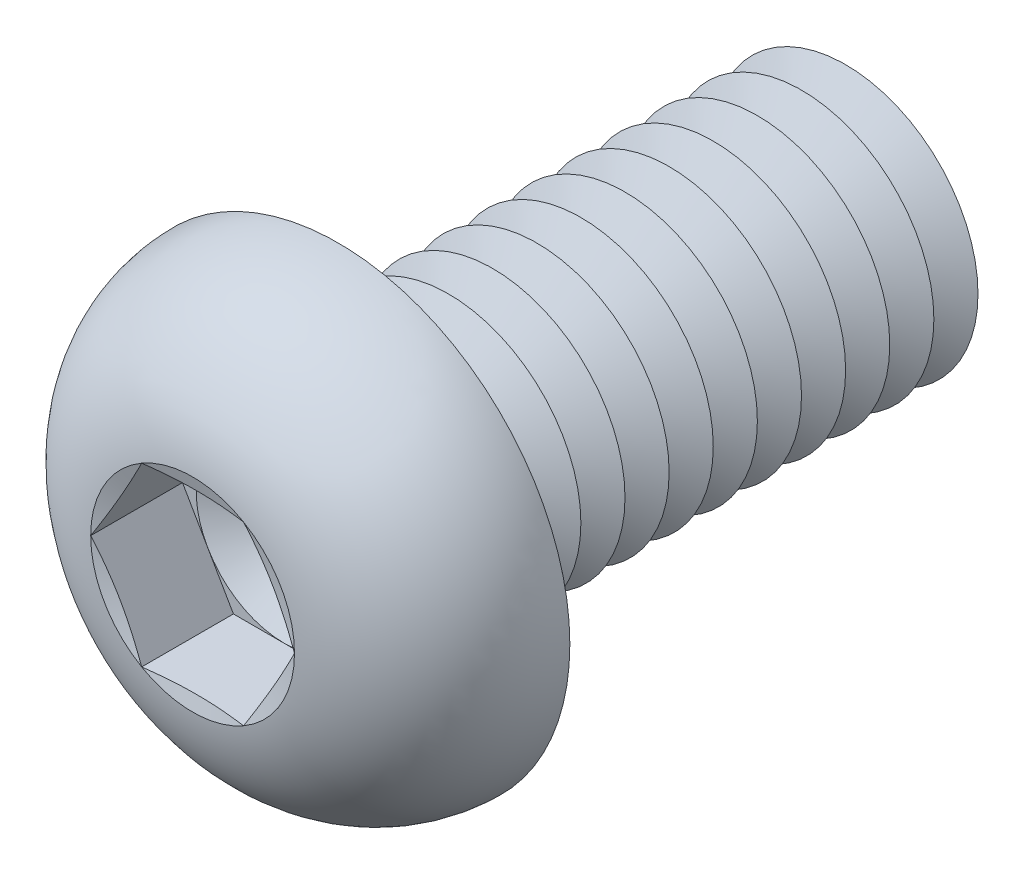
from build123d import *

# Parameters (mm, degrees)
FILLET1_R          = 0.5
LPATTERN1_COUNT    = 12
LPATTERN1_PITCH    = 1
CUT_EXTRUDE1_DEPTH = 2.08


with BuildPart() as part:
    # Sketch1 → Revolve1 (revolve)
    with BuildSketch(Plane(origin=(0, 0, 0), x_dir=(0, 0, -1), z_dir=(1, 0, 0)), mode=Mode.PRIVATE) as revolve1_sk:
        with BuildLine():
            Line((0, 3), (0, 5.25))
            ThreePointArc((0, 5.25), (-2.210041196, 4.408189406), (-3.3, 2.3094))
            Line((-3.3, 2.3094), (-2.990599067, 1.1547))
            Line((-2.990599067, 1.1547), (-3.3, 1.1547))
            Line((-3.3, 1.1547), (-3.3, 0))
            Line((-3.3, 0), (12, 0))
            Line((12, 0), (12, 3))
            Line((12, 3), (0, 3))
        make_face()
    revolve(revolve1_sk.sketch.rotate(Axis((0, 0, -12), (0, 0, 1)), 90), axis=Axis((0, 0, -12), (0, 0, 1)))

    # Fillet1
    fillet1_edges = [part.edges().sort_by_distance(p)[0] for p in [
        (3, 0, 0),
    ]]
    fillet(fillet1_edges, radius=FILLET1_R)

    # Sketch2 → Cut-Revolve1 (revolve, cut)
    with BuildSketch(Plane(origin=(0, 0, 0), x_dir=(0, 0, -1), z_dir=(1, 0, 0)), mode=Mode.PRIVATE) as cut_revolve1_sk:
        Polygon((11.5, 3), (12.5, 3), (12, 2.133974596), align=None)
    cut_revolve1 = revolve(cut_revolve1_sk.sketch.rotate(Axis((0, 0, -12), (0, 0, -1)), 270), axis=Axis((0, 0, -12), (0, 0, -1)), mode=Mode.SUBTRACT)

    # LPattern1: Cut-Revolve1 ×12
    with Locations(*[(0, 0, i * LPATTERN1_PITCH) for i in range(1, LPATTERN1_COUNT)]):
        add(cut_revolve1, mode=Mode.SUBTRACT)

    # Sketch3 → Cut-Extrude1 (cut)
    with BuildSketch(Plane.XY.offset(3.3)):
        Polygon((1.1547, 1.999999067), (-1.1547, 1.999999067), (-2.3094, 0), (-1.1547, -1.999999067), (1.1547, -1.999999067), (2.3094, 0), align=None)
    extrude(amount=-CUT_EXTRUDE1_DEPTH, mode=Mode.SUBTRACT)

    # Cut-Extrude2 cone 1 section (on through the dimple's axis) → Cut-Extrude2 (revolve, cut)
    with BuildSketch(Plane(origin=(0, 0, 1.22), x_dir=(0, -1, 0), z_dir=(1, 0, 0))):
        Polygon((0, 0), (1.999999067, 0), (0, 1.1547), align=None)
    revolve(axis=Axis((0, 0, 1.22), (0, 0, -1)), mode=Mode.SUBTRACT)


solid = part.part
